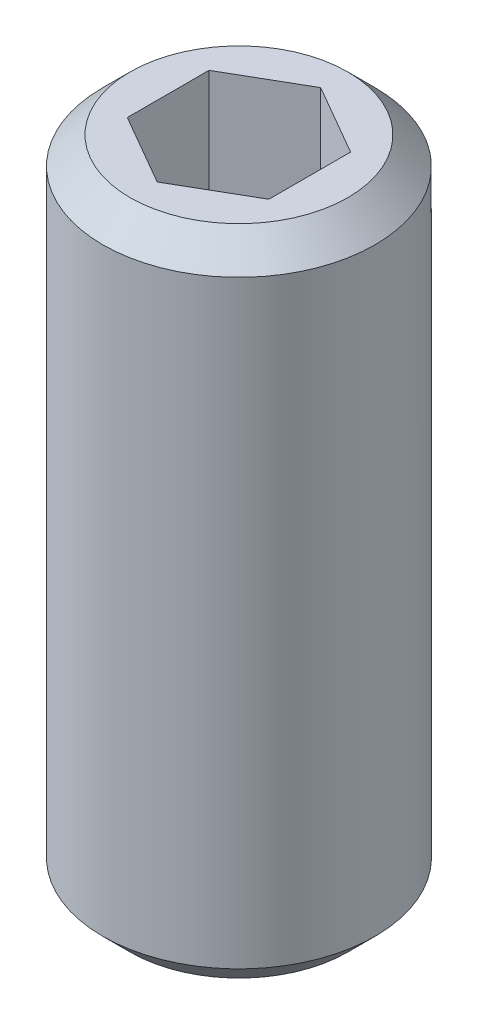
ISO-10303-21;
HEADER;
FILE_DESCRIPTION(('STEP AP214'),'2;1');
FILE_NAME('part.step','',(''),(''),'','','');
FILE_SCHEMA(('AUTOMOTIVE_DESIGN { 1 0 10303 214 1 1 1 1 }'));
ENDSEC;
DATA;
#1=APPLICATION_CONTEXT('core data for automotive mechanical design processes');
#2=APPLICATION_PROTOCOL_DEFINITION('international standard','automotive_design',2000,#1);
#3=PRODUCT_CONTEXT('',#1,'mechanical');
#4=PRODUCT('Part','Part','',(#3));
#5=PRODUCT_RELATED_PRODUCT_CATEGORY('part','',(#4));
#6=PRODUCT_DEFINITION_FORMATION('','',#4);
#7=PRODUCT_DEFINITION_CONTEXT('part definition',#1,'design');
#8=PRODUCT_DEFINITION('design','',#6,#7);
#9=PRODUCT_DEFINITION_SHAPE('','',#8);
#10=(LENGTH_UNIT() NAMED_UNIT(*) SI_UNIT(.MILLI.,.METRE.));
#11=(NAMED_UNIT(*) PLANE_ANGLE_UNIT() SI_UNIT($,.RADIAN.));
#12=(NAMED_UNIT(*) SI_UNIT($,.STERADIAN.) SOLID_ANGLE_UNIT());
#13=UNCERTAINTY_MEASURE_WITH_UNIT(LENGTH_MEASURE(1.E-05),#10,'distance_accuracy_value','');
#14=(GEOMETRIC_REPRESENTATION_CONTEXT(3) GLOBAL_UNCERTAINTY_ASSIGNED_CONTEXT((#13)) GLOBAL_UNIT_ASSIGNED_CONTEXT((#10,
#11,#12)) REPRESENTATION_CONTEXT('',''));
#15=CARTESIAN_POINT('',(0.,0.,0.));
#16=DIRECTION('',(0.,0.,1.));
#17=DIRECTION('',(1.,0.,0.));
#18=AXIS2_PLACEMENT_3D('',#15,#16,#17);
#19=CARTESIAN_POINT('',(0.,-6.,0.));
#20=DIRECTION('',(0.,1.,0.));
#21=DIRECTION('',(0.,0.,1.));
#22=AXIS2_PLACEMENT_3D('',#19,#20,#21);
#23=PLANE('',#22);
#24=CARTESIAN_POINT('',(0.,-6.,0.));
#25=DIRECTION('',(0.,1.,0.));
#26=DIRECTION('',(0.,0.,1.));
#27=AXIS2_PLACEMENT_3D('',#24,#25,#26);
#28=CIRCLE('',#27,1.);
#29=CARTESIAN_POINT('',(0.,-6.,1.));
#30=VERTEX_POINT('',#29);
#31=EDGE_CURVE('E473',#30,#30,#28,.F.);
#32=ORIENTED_EDGE('',*,*,#31,.T.);
#33=EDGE_LOOP('',(#32));
#34=FACE_BOUND('',#33,.T.);
#35=ADVANCED_FACE('F362',(#34),#23,.F.);
#36=CARTESIAN_POINT('',(0.,0.,0.));
#37=DIRECTION('',(0.,1.,0.));
#38=DIRECTION('',(0.,0.,1.));
#39=AXIS2_PLACEMENT_3D('',#36,#37,#38);
#40=CYLINDRICAL_SURFACE('',#39,1.25);
#41=CARTESIAN_POINT('',(0.,-0.250000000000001,0.));
#42=DIRECTION('',(0.,-1.,0.));
#43=DIRECTION('',(0.,0.,-1.));
#44=AXIS2_PLACEMENT_3D('',#41,#42,#43);
#45=CIRCLE('',#44,1.25);
#46=CARTESIAN_POINT('',(0.,-0.250000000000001,-1.25));
#47=VERTEX_POINT('',#46);
#48=EDGE_CURVE('E11',#47,#47,#45,.T.);
#49=ORIENTED_EDGE('',*,*,#48,.T.);
#50=EDGE_LOOP('',(#49));
#51=FACE_BOUND('',#50,.T.);
#52=CARTESIAN_POINT('',(0.,-5.75,0.));
#53=DIRECTION('',(0.,1.,0.));
#54=DIRECTION('',(0.,0.,1.));
#55=AXIS2_PLACEMENT_3D('',#52,#53,#54);
#56=CIRCLE('',#55,1.25);
#57=CARTESIAN_POINT('',(0.,-5.75,1.25));
#58=VERTEX_POINT('',#57);
#59=EDGE_CURVE('E464',#58,#58,#56,.T.);
#60=ORIENTED_EDGE('',*,*,#59,.T.);
#61=EDGE_LOOP('',(#60));
#62=FACE_BOUND('',#61,.T.);
#63=ADVANCED_FACE('F496',(#51,#62),#40,.T.);
#64=CARTESIAN_POINT('',(0.,0.,0.));
#65=DIRECTION('',(0.,-1.,0.));
#66=DIRECTION('',(0.,0.,-1.));
#67=AXIS2_PLACEMENT_3D('',#64,#65,#66);
#68=PLANE('',#67);
#69=DIRECTION('',(0.866025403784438,0.,-0.500000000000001));
#70=VECTOR('',#69,1.);
#71=CARTESIAN_POINT('',(0.,0.,0.750555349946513));
#72=LINE('',#71,#70);
#73=CARTESIAN_POINT('',(0.,0.,0.750555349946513));
#74=VERTEX_POINT('',#73);
#75=CARTESIAN_POINT('',(0.649999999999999,0.,0.375277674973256));
#76=VERTEX_POINT('',#75);
#77=EDGE_CURVE('E430',#74,#76,#72,.T.);
#78=ORIENTED_EDGE('',*,*,#77,.F.);
#79=DIRECTION('',(0.866025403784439,0.,0.5));
#80=VECTOR('',#79,1.);
#81=CARTESIAN_POINT('',(-0.649999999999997,0.,0.375277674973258));
#82=LINE('',#81,#80);
#83=CARTESIAN_POINT('',(-0.649999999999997,0.,0.375277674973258));
#84=VERTEX_POINT('',#83);
#85=EDGE_CURVE('E376',#84,#74,#82,.T.);
#86=ORIENTED_EDGE('',*,*,#85,.F.);
#87=DIRECTION('',(0.,0.,1.));
#88=VECTOR('',#87,1.);
#89=CARTESIAN_POINT('',(-0.649999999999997,0.,-0.375277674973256));
#90=LINE('',#89,#88);
#91=CARTESIAN_POINT('',(-0.649999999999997,0.,-0.375277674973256));
#92=VERTEX_POINT('',#91);
#93=EDGE_CURVE('E446',#92,#84,#90,.T.);
#94=ORIENTED_EDGE('',*,*,#93,.F.);
#95=DIRECTION('',(-0.866025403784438,0.,0.5));
#96=VECTOR('',#95,1.);
#97=CARTESIAN_POINT('',(0.,0.,-0.750555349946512));
#98=LINE('',#97,#96);
#99=CARTESIAN_POINT('',(0.,0.,-0.750555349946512));
#100=VERTEX_POINT('',#99);
#101=EDGE_CURVE('E440',#100,#92,#98,.T.);
#102=ORIENTED_EDGE('',*,*,#101,.F.);
#103=DIRECTION('',(-0.866025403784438,0.,-0.5));
#104=VECTOR('',#103,1.);
#105=CARTESIAN_POINT('',(0.649999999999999,0.,-0.375277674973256));
#106=LINE('',#105,#104);
#107=CARTESIAN_POINT('',(0.649999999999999,0.,-0.375277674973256));
#108=VERTEX_POINT('',#107);
#109=EDGE_CURVE('E438',#108,#100,#106,.T.);
#110=ORIENTED_EDGE('',*,*,#109,.F.);
#111=DIRECTION('',(0.,0.,-1.));
#112=VECTOR('',#111,1.);
#113=CARTESIAN_POINT('',(0.649999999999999,0.,0.375277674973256));
#114=LINE('',#113,#112);
#115=EDGE_CURVE('E419',#76,#108,#114,.T.);
#116=ORIENTED_EDGE('',*,*,#115,.F.);
#117=EDGE_LOOP('',(#78,#86,#94,#102,#110,#116));
#118=FACE_BOUND('',#117,.T.);
#119=CARTESIAN_POINT('',(0.,0.,0.));
#120=DIRECTION('',(0.,-1.,0.));
#121=DIRECTION('',(0.,0.,-1.));
#122=AXIS2_PLACEMENT_3D('',#119,#120,#121);
#123=CIRCLE('',#122,1.);
#124=CARTESIAN_POINT('',(0.,0.,-1.));
#125=VERTEX_POINT('',#124);
#126=EDGE_CURVE('E369',#125,#125,#123,.F.);
#127=ORIENTED_EDGE('',*,*,#126,.T.);
#128=EDGE_LOOP('',(#127));
#129=FACE_BOUND('',#128,.T.);
#130=ADVANCED_FACE('F434',(#118,#129),#68,.F.);
#131=CARTESIAN_POINT('',(0.,-5.75,0.));
#132=DIRECTION('',(0.,1.,0.));
#133=DIRECTION('',(0.,0.,1.));
#134=AXIS2_PLACEMENT_3D('',#131,#132,#133);
#135=CONICAL_SURFACE('',#134,1.25,0.785398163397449);
#136=ORIENTED_EDGE('',*,*,#31,.F.);
#137=EDGE_LOOP('',(#136));
#138=FACE_BOUND('',#137,.T.);
#139=ORIENTED_EDGE('',*,*,#59,.F.);
#140=EDGE_LOOP('',(#139));
#141=FACE_BOUND('',#140,.T.);
#142=ADVANCED_FACE('F481',(#138,#141),#135,.T.);
#143=CARTESIAN_POINT('',(0.,0.,0.));
#144=DIRECTION('',(0.,-1.,0.));
#145=DIRECTION('',(0.,0.,-1.));
#146=AXIS2_PLACEMENT_3D('',#143,#144,#145);
#147=CONICAL_SURFACE('',#146,1.,0.785398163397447);
#148=ORIENTED_EDGE('',*,*,#48,.F.);
#149=EDGE_LOOP('',(#148));
#150=FACE_BOUND('',#149,.T.);
#151=ORIENTED_EDGE('',*,*,#126,.F.);
#152=EDGE_LOOP('',(#151));
#153=FACE_BOUND('',#152,.T.);
#154=ADVANCED_FACE('F478',(#150,#153),#147,.T.);
#155=CARTESIAN_POINT('',(-0.649999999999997,-2.,0.375277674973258));
#156=DIRECTION('',(-0.5,0.,0.866025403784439));
#157=DIRECTION('',(0.866025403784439,0.,0.5));
#158=AXIS2_PLACEMENT_3D('',#155,#156,#157);
#159=PLANE('',#158);
#160=ORIENTED_EDGE('',*,*,#85,.T.);
#161=DIRECTION('',(0.,1.,0.));
#162=VECTOR('',#161,1.);
#163=CARTESIAN_POINT('',(0.,-2.,0.750555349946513));
#164=LINE('',#163,#162);
#165=CARTESIAN_POINT('',(0.,-2.,0.750555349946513));
#166=VERTEX_POINT('',#165);
#167=EDGE_CURVE('E427',#166,#74,#164,.T.);
#168=ORIENTED_EDGE('',*,*,#167,.F.);
#169=DIRECTION('',(0.866025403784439,0.,0.5));
#170=VECTOR('',#169,1.);
#171=CARTESIAN_POINT('',(-0.649999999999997,-2.,0.375277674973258));
#172=LINE('',#171,#170);
#173=CARTESIAN_POINT('',(-0.649999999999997,-2.,0.375277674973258));
#174=VERTEX_POINT('',#173);
#175=EDGE_CURVE('E448',#174,#166,#172,.T.);
#176=ORIENTED_EDGE('',*,*,#175,.F.);
#177=DIRECTION('',(0.,1.,0.));
#178=VECTOR('',#177,1.);
#179=CARTESIAN_POINT('',(-0.649999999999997,-2.,0.375277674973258));
#180=LINE('',#179,#178);
#181=EDGE_CURVE('E383',#174,#84,#180,.T.);
#182=ORIENTED_EDGE('',*,*,#181,.T.);
#183=EDGE_LOOP('',(#160,#168,#176,#182));
#184=FACE_BOUND('',#183,.T.);
#185=ADVANCED_FACE('F480',(#184),#159,.F.);
#186=CARTESIAN_POINT('',(-0.649999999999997,-2.,-0.375277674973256));
#187=DIRECTION('',(-1.,0.,0.));
#188=DIRECTION('',(0.,0.,1.));
#189=AXIS2_PLACEMENT_3D('',#186,#187,#188);
#190=PLANE('',#189);
#191=ORIENTED_EDGE('',*,*,#93,.T.);
#192=ORIENTED_EDGE('',*,*,#181,.F.);
#193=DIRECTION('',(0.,0.,1.));
#194=VECTOR('',#193,1.);
#195=CARTESIAN_POINT('',(-0.649999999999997,-2.,-0.375277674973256));
#196=LINE('',#195,#194);
#197=CARTESIAN_POINT('',(-0.649999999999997,-2.,-0.375277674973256));
#198=VERTEX_POINT('',#197);
#199=EDGE_CURVE('E460',#198,#174,#196,.T.);
#200=ORIENTED_EDGE('',*,*,#199,.F.);
#201=DIRECTION('',(0.,1.,0.));
#202=VECTOR('',#201,1.);
#203=CARTESIAN_POINT('',(-0.649999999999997,-2.,-0.375277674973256));
#204=LINE('',#203,#202);
#205=EDGE_CURVE('E465',#198,#92,#204,.T.);
#206=ORIENTED_EDGE('',*,*,#205,.T.);
#207=EDGE_LOOP('',(#191,#192,#200,#206));
#208=FACE_BOUND('',#207,.T.);
#209=ADVANCED_FACE('F489',(#208),#190,.F.);
#210=CARTESIAN_POINT('',(0.,-2.,-0.750555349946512));
#211=DIRECTION('',(-0.5,0.,-0.866025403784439));
#212=DIRECTION('',(-0.866025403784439,0.,0.5));
#213=AXIS2_PLACEMENT_3D('',#210,#211,#212);
#214=PLANE('',#213);
#215=ORIENTED_EDGE('',*,*,#101,.T.);
#216=ORIENTED_EDGE('',*,*,#205,.F.);
#217=DIRECTION('',(-0.866025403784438,0.,0.5));
#218=VECTOR('',#217,1.);
#219=CARTESIAN_POINT('',(0.,-2.,-0.750555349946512));
#220=LINE('',#219,#218);
#221=CARTESIAN_POINT('',(0.,-2.,-0.750555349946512));
#222=VERTEX_POINT('',#221);
#223=EDGE_CURVE('E457',#222,#198,#220,.T.);
#224=ORIENTED_EDGE('',*,*,#223,.F.);
#225=DIRECTION('',(0.,1.,0.));
#226=VECTOR('',#225,1.);
#227=CARTESIAN_POINT('',(0.,-2.,-0.750555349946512));
#228=LINE('',#227,#226);
#229=EDGE_CURVE('E467',#222,#100,#228,.T.);
#230=ORIENTED_EDGE('',*,*,#229,.T.);
#231=EDGE_LOOP('',(#215,#216,#224,#230));
#232=FACE_BOUND('',#231,.T.);
#233=ADVANCED_FACE('F521',(#232),#214,.F.);
#234=CARTESIAN_POINT('',(0.649999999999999,-2.,-0.375277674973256));
#235=DIRECTION('',(0.5,0.,-0.866025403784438));
#236=DIRECTION('',(-0.866025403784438,0.,-0.5));
#237=AXIS2_PLACEMENT_3D('',#234,#235,#236);
#238=PLANE('',#237);
#239=ORIENTED_EDGE('',*,*,#109,.T.);
#240=ORIENTED_EDGE('',*,*,#229,.F.);
#241=DIRECTION('',(-0.866025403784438,0.,-0.5));
#242=VECTOR('',#241,1.);
#243=CARTESIAN_POINT('',(0.649999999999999,-2.,-0.375277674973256));
#244=LINE('',#243,#242);
#245=CARTESIAN_POINT('',(0.649999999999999,-2.,-0.375277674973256));
#246=VERTEX_POINT('',#245);
#247=EDGE_CURVE('E454',#246,#222,#244,.T.);
#248=ORIENTED_EDGE('',*,*,#247,.F.);
#249=DIRECTION('',(0.,1.,0.));
#250=VECTOR('',#249,1.);
#251=CARTESIAN_POINT('',(0.649999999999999,-2.,-0.375277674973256));
#252=LINE('',#251,#250);
#253=EDGE_CURVE('E426',#246,#108,#252,.T.);
#254=ORIENTED_EDGE('',*,*,#253,.T.);
#255=EDGE_LOOP('',(#239,#240,#248,#254));
#256=FACE_BOUND('',#255,.T.);
#257=ADVANCED_FACE('F528',(#256),#238,.F.);
#258=CARTESIAN_POINT('',(0.649999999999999,-2.,0.375277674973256));
#259=DIRECTION('',(1.,0.,0.));
#260=DIRECTION('',(0.,0.,-1.));
#261=AXIS2_PLACEMENT_3D('',#258,#259,#260);
#262=PLANE('',#261);
#263=ORIENTED_EDGE('',*,*,#115,.T.);
#264=ORIENTED_EDGE('',*,*,#253,.F.);
#265=DIRECTION('',(0.,0.,-1.));
#266=VECTOR('',#265,1.);
#267=CARTESIAN_POINT('',(0.649999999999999,-2.,0.375277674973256));
#268=LINE('',#267,#266);
#269=CARTESIAN_POINT('',(0.649999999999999,-2.,0.375277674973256));
#270=VERTEX_POINT('',#269);
#271=EDGE_CURVE('E422',#270,#246,#268,.T.);
#272=ORIENTED_EDGE('',*,*,#271,.F.);
#273=DIRECTION('',(0.,1.,0.));
#274=VECTOR('',#273,1.);
#275=CARTESIAN_POINT('',(0.649999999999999,-2.,0.375277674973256));
#276=LINE('',#275,#274);
#277=EDGE_CURVE('E415',#270,#76,#276,.T.);
#278=ORIENTED_EDGE('',*,*,#277,.T.);
#279=EDGE_LOOP('',(#263,#264,#272,#278));
#280=FACE_BOUND('',#279,.T.);
#281=ADVANCED_FACE('F417',(#280),#262,.F.);
#282=CARTESIAN_POINT('',(0.,-2.,0.750555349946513));
#283=DIRECTION('',(0.500000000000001,0.,0.866025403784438));
#284=DIRECTION('',(0.866025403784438,0.,-0.500000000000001));
#285=AXIS2_PLACEMENT_3D('',#282,#283,#284);
#286=PLANE('',#285);
#287=ORIENTED_EDGE('',*,*,#77,.T.);
#288=ORIENTED_EDGE('',*,*,#277,.F.);
#289=DIRECTION('',(0.866025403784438,0.,-0.500000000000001));
#290=VECTOR('',#289,1.);
#291=CARTESIAN_POINT('',(0.,-2.,0.750555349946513));
#292=LINE('',#291,#290);
#293=EDGE_CURVE('E451',#166,#270,#292,.T.);
#294=ORIENTED_EDGE('',*,*,#293,.F.);
#295=ORIENTED_EDGE('',*,*,#167,.T.);
#296=EDGE_LOOP('',(#287,#288,#294,#295));
#297=FACE_BOUND('',#296,.T.);
#298=ADVANCED_FACE('F431',(#297),#286,.F.);
#299=CARTESIAN_POINT('',(0.,-2.,0.750555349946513));
#300=DIRECTION('',(0.,1.,0.));
#301=DIRECTION('',(0.,0.,1.));
#302=AXIS2_PLACEMENT_3D('',#299,#300,#301);
#303=PLANE('',#302);
#304=ORIENTED_EDGE('',*,*,#175,.T.);
#305=ORIENTED_EDGE('',*,*,#293,.T.);
#306=ORIENTED_EDGE('',*,*,#271,.T.);
#307=ORIENTED_EDGE('',*,*,#247,.T.);
#308=ORIENTED_EDGE('',*,*,#223,.T.);
#309=ORIENTED_EDGE('',*,*,#199,.T.);
#310=EDGE_LOOP('',(#304,#305,#306,#307,#308,#309));
#311=FACE_BOUND('',#310,.T.);
#312=ADVANCED_FACE('F549',(#311),#303,.T.);
#313=CLOSED_SHELL('',(#35,#63,#130,#142,#154,#185,#209,#233,#257,#281,#298,#312));
#314=MANIFOLD_SOLID_BREP('B2',#313);
#315=ADVANCED_BREP_SHAPE_REPRESENTATION('',(#18,#314),#14);
#316=SHAPE_DEFINITION_REPRESENTATION(#9,#315);
ENDSEC;
END-ISO-10303-21;
